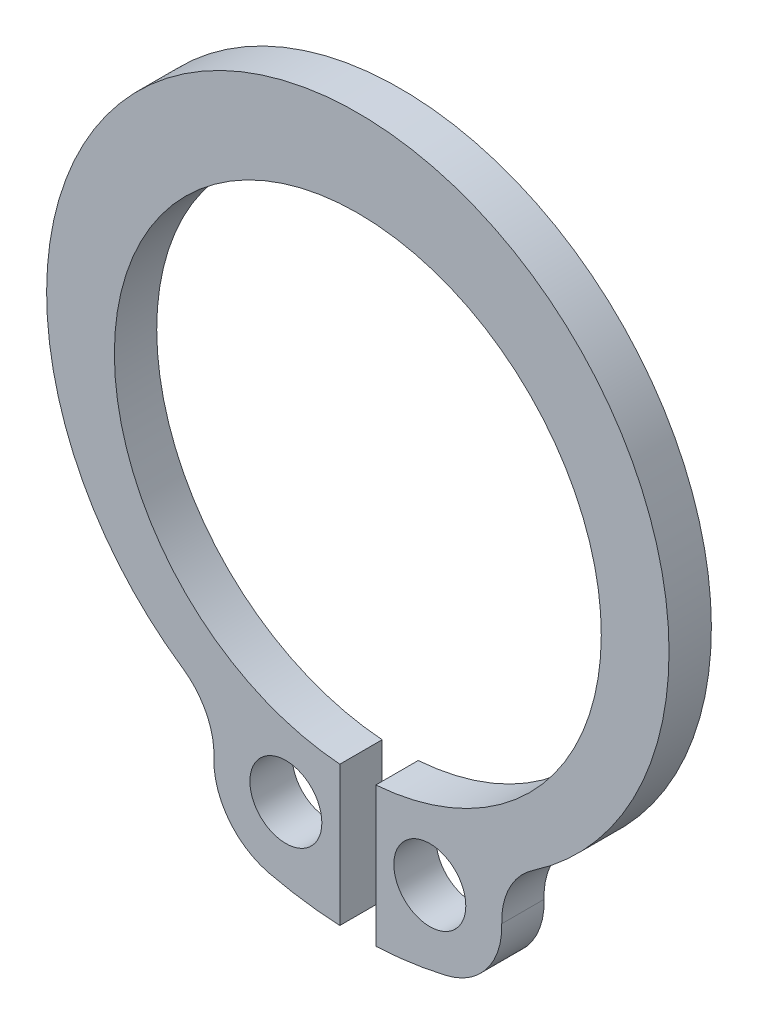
ISO-10303-21;
HEADER;
FILE_DESCRIPTION(('STEP AP214'),'2;1');
FILE_NAME('part.step','',(''),(''),'','','');
FILE_SCHEMA(('AUTOMOTIVE_DESIGN { 1 0 10303 214 1 1 1 1 }'));
ENDSEC;
DATA;
#1=APPLICATION_CONTEXT('core data for automotive mechanical design processes');
#2=APPLICATION_PROTOCOL_DEFINITION('international standard','automotive_design',2000,#1);
#3=PRODUCT_CONTEXT('',#1,'mechanical');
#4=PRODUCT('Part','Part','',(#3));
#5=PRODUCT_RELATED_PRODUCT_CATEGORY('part','',(#4));
#6=PRODUCT_DEFINITION_FORMATION('','',#4);
#7=PRODUCT_DEFINITION_CONTEXT('part definition',#1,'design');
#8=PRODUCT_DEFINITION('design','',#6,#7);
#9=PRODUCT_DEFINITION_SHAPE('','',#8);
#10=(LENGTH_UNIT() NAMED_UNIT(*) SI_UNIT(.MILLI.,.METRE.));
#11=(NAMED_UNIT(*) PLANE_ANGLE_UNIT() SI_UNIT($,.RADIAN.));
#12=(NAMED_UNIT(*) SI_UNIT($,.STERADIAN.) SOLID_ANGLE_UNIT());
#13=UNCERTAINTY_MEASURE_WITH_UNIT(LENGTH_MEASURE(1.E-05),#10,'distance_accuracy_value','');
#14=(GEOMETRIC_REPRESENTATION_CONTEXT(3) GLOBAL_UNCERTAINTY_ASSIGNED_CONTEXT((#13)) GLOBAL_UNIT_ASSIGNED_CONTEXT((#10,
#11,#12)) REPRESENTATION_CONTEXT('',''));
#15=CARTESIAN_POINT('',(0.,0.,0.));
#16=DIRECTION('',(0.,0.,1.));
#17=DIRECTION('',(1.,0.,0.));
#18=AXIS2_PLACEMENT_3D('',#15,#16,#17);
#19=CARTESIAN_POINT('',(0.,-7.12348782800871,1.));
#20=DIRECTION('',(0.,0.,1.));
#21=DIRECTION('',(1.,0.,0.));
#22=AXIS2_PLACEMENT_3D('',#19,#20,#21);
#23=PLANE('',#22);
#24=CARTESIAN_POINT('',(0.,-5.55,1.));
#25=DIRECTION('',(0.,0.,1.));
#26=DIRECTION('',(1.,0.,0.));
#27=AXIS2_PLACEMENT_3D('',#24,#25,#26);
#28=CIRCLE('',#27,7.35);
#29=CARTESIAN_POINT('',(-4.14034530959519,-11.6228939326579,1.));
#30=VERTEX_POINT('',#29);
#31=CARTESIAN_POINT('',(4.14034530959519,-11.6228939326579,1.));
#32=VERTEX_POINT('',#31);
#33=EDGE_CURVE('E126',#30,#32,#28,.F.);
#34=ORIENTED_EDGE('',*,*,#33,.F.);
#35=CARTESIAN_POINT('',(-5.09797619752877,-13.0275088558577,1.));
#36=DIRECTION('',(0.,0.,1.));
#37=DIRECTION('',(1.,0.,0.));
#38=AXIS2_PLACEMENT_3D('',#35,#36,#37);
#39=CIRCLE('',#38,1.7);
#40=CARTESIAN_POINT('',(-3.39898809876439,-13.0861555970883,1.));
#41=VERTEX_POINT('',#40);
#42=EDGE_CURVE('E123',#41,#30,#39,.T.);
#43=ORIENTED_EDGE('',*,*,#42,.F.);
#44=CARTESIAN_POINT('',(-1.7,-13.1448023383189,1.));
#45=DIRECTION('',(0.,0.,1.));
#46=DIRECTION('',(1.,0.,0.));
#47=AXIS2_PLACEMENT_3D('',#44,#45,#46);
#48=CIRCLE('',#47,1.7);
#49=CARTESIAN_POINT('',(-2.09350442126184,-14.7986325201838,1.));
#50=VERTEX_POINT('',#49);
#51=EDGE_CURVE('E99',#50,#41,#48,.F.);
#52=ORIENTED_EDGE('',*,*,#51,.F.);
#53=CARTESIAN_POINT('',(0.,-6.,1.));
#54=DIRECTION('',(0.,0.,1.));
#55=DIRECTION('',(1.,0.,0.));
#56=AXIS2_PLACEMENT_3D('',#53,#54,#55);
#57=CIRCLE('',#56,9.04426309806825);
#58=CARTESIAN_POINT('',(-0.425000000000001,-15.0342719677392,1.));
#59=VERTEX_POINT('',#58);
#60=EDGE_CURVE('E20',#50,#59,#57,.T.);
#61=ORIENTED_EDGE('',*,*,#60,.T.);
#62=DIRECTION('',(0.,1.,0.));
#63=VECTOR('',#62,1.);
#64=CARTESIAN_POINT('',(-0.425,-11.7342719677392,1.));
#65=LINE('',#64,#63);
#66=CARTESIAN_POINT('',(-0.425,-11.7342719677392,1.));
#67=VERTEX_POINT('',#66);
#68=EDGE_CURVE('E96',#67,#59,#65,.F.);
#69=ORIENTED_EDGE('',*,*,#68,.F.);
#70=CARTESIAN_POINT('',(0.,-6.,1.));
#71=DIRECTION('',(0.,0.,1.));
#72=DIRECTION('',(1.,0.,0.));
#73=AXIS2_PLACEMENT_3D('',#70,#71,#72);
#74=CIRCLE('',#73,5.75);
#75=CARTESIAN_POINT('',(0.425,-11.7342719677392,1.));
#76=VERTEX_POINT('',#75);
#77=EDGE_CURVE('E107',#76,#67,#74,.T.);
#78=ORIENTED_EDGE('',*,*,#77,.F.);
#79=DIRECTION('',(0.,-1.,0.));
#80=VECTOR('',#79,1.);
#81=CARTESIAN_POINT('',(0.424999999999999,-15.0342719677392,1.));
#82=LINE('',#81,#80);
#83=CARTESIAN_POINT('',(0.424999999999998,-15.0342719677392,1.));
#84=VERTEX_POINT('',#83);
#85=EDGE_CURVE('E138',#84,#76,#82,.F.);
#86=ORIENTED_EDGE('',*,*,#85,.F.);
#87=CARTESIAN_POINT('',(0.,-6.,1.));
#88=DIRECTION('',(0.,0.,1.));
#89=DIRECTION('',(1.,0.,0.));
#90=AXIS2_PLACEMENT_3D('',#87,#88,#89);
#91=CIRCLE('',#90,9.04426309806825);
#92=CARTESIAN_POINT('',(2.09350442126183,-14.7986325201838,1.));
#93=VERTEX_POINT('',#92);
#94=EDGE_CURVE('E135',#93,#84,#91,.F.);
#95=ORIENTED_EDGE('',*,*,#94,.F.);
#96=CARTESIAN_POINT('',(1.7,-13.1448023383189,1.));
#97=DIRECTION('',(0.,0.,1.));
#98=DIRECTION('',(1.,0.,0.));
#99=AXIS2_PLACEMENT_3D('',#96,#97,#98);
#100=CIRCLE('',#99,1.7);
#101=CARTESIAN_POINT('',(3.39898809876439,-13.0861555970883,1.));
#102=VERTEX_POINT('',#101);
#103=EDGE_CURVE('E132',#102,#93,#100,.F.);
#104=ORIENTED_EDGE('',*,*,#103,.F.);
#105=CARTESIAN_POINT('',(5.09797619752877,-13.0275088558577,1.));
#106=DIRECTION('',(0.,0.,1.));
#107=DIRECTION('',(1.,0.,0.));
#108=AXIS2_PLACEMENT_3D('',#105,#106,#107);
#109=CIRCLE('',#108,1.7);
#110=EDGE_CURVE('E129',#32,#102,#109,.T.);
#111=ORIENTED_EDGE('',*,*,#110,.F.);
#112=EDGE_LOOP('',(#34,#43,#52,#61,#69,#78,#86,#95,#104,#111));
#113=FACE_BOUND('',#112,.T.);
#114=CARTESIAN_POINT('',(-1.7,-13.1448023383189,1.));
#115=DIRECTION('',(0.,0.,1.));
#116=DIRECTION('',(1.,0.,0.));
#117=AXIS2_PLACEMENT_3D('',#114,#115,#116);
#118=CIRCLE('',#117,0.85);
#119=CARTESIAN_POINT('',(-0.85,-13.1448023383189,1.));
#120=VERTEX_POINT('',#119);
#121=EDGE_CURVE('E108',#120,#120,#118,.F.);
#122=ORIENTED_EDGE('',*,*,#121,.T.);
#123=EDGE_LOOP('',(#122));
#124=FACE_BOUND('',#123,.T.);
#125=CARTESIAN_POINT('',(1.7,-13.1448023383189,1.));
#126=DIRECTION('',(0.,0.,1.));
#127=DIRECTION('',(1.,0.,0.));
#128=AXIS2_PLACEMENT_3D('',#125,#126,#127);
#129=CIRCLE('',#128,0.85);
#130=CARTESIAN_POINT('',(2.55,-13.1448023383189,1.));
#131=VERTEX_POINT('',#130);
#132=EDGE_CURVE('E100',#131,#131,#129,.F.);
#133=ORIENTED_EDGE('',*,*,#132,.T.);
#134=EDGE_LOOP('',(#133));
#135=FACE_BOUND('',#134,.T.);
#136=ADVANCED_FACE('F16',(#113,#124,#135),#23,.T.);
#137=CARTESIAN_POINT('',(1.7,-13.1448023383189,0.));
#138=DIRECTION('',(0.,0.,1.));
#139=DIRECTION('',(1.,0.,0.));
#140=AXIS2_PLACEMENT_3D('',#137,#138,#139);
#141=CYLINDRICAL_SURFACE('',#140,0.85);
#142=CARTESIAN_POINT('',(1.7,-13.1448023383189,0.));
#143=DIRECTION('',(0.,0.,1.));
#144=DIRECTION('',(1.,0.,0.));
#145=AXIS2_PLACEMENT_3D('',#142,#143,#144);
#146=CIRCLE('',#145,0.85);
#147=CARTESIAN_POINT('',(2.55,-13.1448023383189,0.));
#148=VERTEX_POINT('',#147);
#149=EDGE_CURVE('E111',#148,#148,#146,.F.);
#150=ORIENTED_EDGE('',*,*,#149,.T.);
#151=EDGE_LOOP('',(#150));
#152=FACE_BOUND('',#151,.T.);
#153=ORIENTED_EDGE('',*,*,#132,.F.);
#154=EDGE_LOOP('',(#153));
#155=FACE_BOUND('',#154,.T.);
#156=ADVANCED_FACE('F177',(#152,#155),#141,.F.);
#157=CARTESIAN_POINT('',(-1.7,-13.1448023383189,0.));
#158=DIRECTION('',(0.,0.,1.));
#159=DIRECTION('',(1.,0.,0.));
#160=AXIS2_PLACEMENT_3D('',#157,#158,#159);
#161=CYLINDRICAL_SURFACE('',#160,0.85);
#162=CARTESIAN_POINT('',(-1.7,-13.1448023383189,0.));
#163=DIRECTION('',(0.,0.,1.));
#164=DIRECTION('',(1.,0.,0.));
#165=AXIS2_PLACEMENT_3D('',#162,#163,#164);
#166=CIRCLE('',#165,0.85);
#167=CARTESIAN_POINT('',(-0.85,-13.1448023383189,0.));
#168=VERTEX_POINT('',#167);
#169=EDGE_CURVE('E114',#168,#168,#166,.F.);
#170=ORIENTED_EDGE('',*,*,#169,.T.);
#171=EDGE_LOOP('',(#170));
#172=FACE_BOUND('',#171,.T.);
#173=ORIENTED_EDGE('',*,*,#121,.F.);
#174=EDGE_LOOP('',(#173));
#175=FACE_BOUND('',#174,.T.);
#176=ADVANCED_FACE('F179',(#172,#175),#161,.F.);
#177=CARTESIAN_POINT('',(-0.425,-11.7342719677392,0.));
#178=DIRECTION('',(1.,0.,0.));
#179=DIRECTION('',(0.,0.,-1.));
#180=AXIS2_PLACEMENT_3D('',#177,#178,#179);
#181=PLANE('',#180);
#182=DIRECTION('',(0.,1.,0.));
#183=VECTOR('',#182,1.);
#184=CARTESIAN_POINT('',(-0.424999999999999,-7.12348782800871,0.));
#185=LINE('',#184,#183);
#186=CARTESIAN_POINT('',(-0.425,-15.0342719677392,0.));
#187=VERTEX_POINT('',#186);
#188=CARTESIAN_POINT('',(-0.425,-11.7342719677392,0.));
#189=VERTEX_POINT('',#188);
#190=EDGE_CURVE('E162',#187,#189,#185,.T.);
#191=ORIENTED_EDGE('',*,*,#190,.T.);
#192=DIRECTION('',(0.,0.,1.));
#193=VECTOR('',#192,1.);
#194=CARTESIAN_POINT('',(-0.425,-11.7342719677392,0.));
#195=LINE('',#194,#193);
#196=EDGE_CURVE('E106',#67,#189,#195,.F.);
#197=ORIENTED_EDGE('',*,*,#196,.F.);
#198=ORIENTED_EDGE('',*,*,#68,.T.);
#199=DIRECTION('',(0.,0.,1.));
#200=VECTOR('',#199,1.);
#201=CARTESIAN_POINT('',(-0.425000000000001,-15.0342719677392,0.));
#202=LINE('',#201,#200);
#203=EDGE_CURVE('E105',#187,#59,#202,.T.);
#204=ORIENTED_EDGE('',*,*,#203,.F.);
#205=EDGE_LOOP('',(#191,#197,#198,#204));
#206=FACE_BOUND('',#205,.T.);
#207=ADVANCED_FACE('F104',(#206),#181,.T.);
#208=CARTESIAN_POINT('',(0.,-6.,0.));
#209=DIRECTION('',(0.,0.,1.));
#210=DIRECTION('',(1.,0.,0.));
#211=AXIS2_PLACEMENT_3D('',#208,#209,#210);
#212=CYLINDRICAL_SURFACE('',#211,5.75);
#213=CARTESIAN_POINT('',(0.,-6.,0.));
#214=DIRECTION('',(0.,0.,1.));
#215=DIRECTION('',(1.,0.,0.));
#216=AXIS2_PLACEMENT_3D('',#213,#214,#215);
#217=CIRCLE('',#216,5.75);
#218=CARTESIAN_POINT('',(0.425,-11.7342719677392,0.));
#219=VERTEX_POINT('',#218);
#220=EDGE_CURVE('E159',#189,#219,#217,.F.);
#221=ORIENTED_EDGE('',*,*,#220,.T.);
#222=DIRECTION('',(0.,0.,1.));
#223=VECTOR('',#222,1.);
#224=CARTESIAN_POINT('',(0.425,-11.7342719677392,0.));
#225=LINE('',#224,#223);
#226=EDGE_CURVE('E136',#76,#219,#225,.F.);
#227=ORIENTED_EDGE('',*,*,#226,.F.);
#228=ORIENTED_EDGE('',*,*,#77,.T.);
#229=ORIENTED_EDGE('',*,*,#196,.T.);
#230=EDGE_LOOP('',(#221,#227,#228,#229));
#231=FACE_BOUND('',#230,.T.);
#232=ADVANCED_FACE('F235',(#231),#212,.F.);
#233=CARTESIAN_POINT('',(0.424999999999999,-15.0342719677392,0.));
#234=DIRECTION('',(-1.,0.,0.));
#235=DIRECTION('',(0.,-1.,0.));
#236=AXIS2_PLACEMENT_3D('',#233,#234,#235);
#237=PLANE('',#236);
#238=DIRECTION('',(0.,1.,0.));
#239=VECTOR('',#238,1.);
#240=CARTESIAN_POINT('',(0.425,-7.12348782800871,0.));
#241=LINE('',#240,#239);
#242=CARTESIAN_POINT('',(0.424999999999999,-15.0342719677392,0.));
#243=VERTEX_POINT('',#242);
#244=EDGE_CURVE('E158',#219,#243,#241,.F.);
#245=ORIENTED_EDGE('',*,*,#244,.T.);
#246=DIRECTION('',(0.,0.,1.));
#247=VECTOR('',#246,1.);
#248=CARTESIAN_POINT('',(0.424999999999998,-15.0342719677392,0.));
#249=LINE('',#248,#247);
#250=EDGE_CURVE('E133',#84,#243,#249,.F.);
#251=ORIENTED_EDGE('',*,*,#250,.F.);
#252=ORIENTED_EDGE('',*,*,#85,.T.);
#253=ORIENTED_EDGE('',*,*,#226,.T.);
#254=EDGE_LOOP('',(#245,#251,#252,#253));
#255=FACE_BOUND('',#254,.T.);
#256=ADVANCED_FACE('F230',(#255),#237,.T.);
#257=CARTESIAN_POINT('',(0.,-6.,0.));
#258=DIRECTION('',(0.,0.,1.));
#259=DIRECTION('',(1.,0.,0.));
#260=AXIS2_PLACEMENT_3D('',#257,#258,#259);
#261=CYLINDRICAL_SURFACE('',#260,9.04426309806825);
#262=CARTESIAN_POINT('',(0.,-6.,0.));
#263=DIRECTION('',(0.,0.,1.));
#264=DIRECTION('',(1.,0.,0.));
#265=AXIS2_PLACEMENT_3D('',#262,#263,#264);
#266=CIRCLE('',#265,9.04426309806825);
#267=CARTESIAN_POINT('',(2.09350442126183,-14.7986325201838,0.));
#268=VERTEX_POINT('',#267);
#269=EDGE_CURVE('E155',#243,#268,#266,.T.);
#270=ORIENTED_EDGE('',*,*,#269,.T.);
#271=DIRECTION('',(0.,0.,1.));
#272=VECTOR('',#271,1.);
#273=CARTESIAN_POINT('',(2.09350442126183,-14.7986325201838,0.));
#274=LINE('',#273,#272);
#275=EDGE_CURVE('E130',#93,#268,#274,.F.);
#276=ORIENTED_EDGE('',*,*,#275,.F.);
#277=ORIENTED_EDGE('',*,*,#94,.T.);
#278=ORIENTED_EDGE('',*,*,#250,.T.);
#279=EDGE_LOOP('',(#270,#276,#277,#278));
#280=FACE_BOUND('',#279,.T.);
#281=ADVANCED_FACE('F226',(#280),#261,.T.);
#282=CARTESIAN_POINT('',(1.7,-13.1448023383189,0.));
#283=DIRECTION('',(0.,0.,1.));
#284=DIRECTION('',(1.,0.,0.));
#285=AXIS2_PLACEMENT_3D('',#282,#283,#284);
#286=CYLINDRICAL_SURFACE('',#285,1.7);
#287=CARTESIAN_POINT('',(1.7,-13.1448023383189,0.));
#288=DIRECTION('',(0.,0.,1.));
#289=DIRECTION('',(1.,0.,0.));
#290=AXIS2_PLACEMENT_3D('',#287,#288,#289);
#291=CIRCLE('',#290,1.7);
#292=CARTESIAN_POINT('',(3.39898809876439,-13.0861555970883,0.));
#293=VERTEX_POINT('',#292);
#294=EDGE_CURVE('E152',#268,#293,#291,.T.);
#295=ORIENTED_EDGE('',*,*,#294,.T.);
#296=DIRECTION('',(0.,0.,1.));
#297=VECTOR('',#296,1.);
#298=CARTESIAN_POINT('',(3.39898809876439,-13.0861555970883,0.));
#299=LINE('',#298,#297);
#300=EDGE_CURVE('E127',#102,#293,#299,.F.);
#301=ORIENTED_EDGE('',*,*,#300,.F.);
#302=ORIENTED_EDGE('',*,*,#103,.T.);
#303=ORIENTED_EDGE('',*,*,#275,.T.);
#304=EDGE_LOOP('',(#295,#301,#302,#303));
#305=FACE_BOUND('',#304,.T.);
#306=ADVANCED_FACE('F219',(#305),#286,.T.);
#307=CARTESIAN_POINT('',(5.09797619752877,-13.0275088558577,0.));
#308=DIRECTION('',(0.,0.,1.));
#309=DIRECTION('',(1.,0.,0.));
#310=AXIS2_PLACEMENT_3D('',#307,#308,#309);
#311=CYLINDRICAL_SURFACE('',#310,1.7);
#312=CARTESIAN_POINT('',(5.09797619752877,-13.0275088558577,0.));
#313=DIRECTION('',(0.,0.,1.));
#314=DIRECTION('',(1.,0.,0.));
#315=AXIS2_PLACEMENT_3D('',#312,#313,#314);
#316=CIRCLE('',#315,1.7);
#317=CARTESIAN_POINT('',(4.14034530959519,-11.6228939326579,0.));
#318=VERTEX_POINT('',#317);
#319=EDGE_CURVE('E149',#293,#318,#316,.F.);
#320=ORIENTED_EDGE('',*,*,#319,.T.);
#321=DIRECTION('',(0.,0.,1.));
#322=VECTOR('',#321,1.);
#323=CARTESIAN_POINT('',(4.14034530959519,-11.6228939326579,0.));
#324=LINE('',#323,#322);
#325=EDGE_CURVE('E124',#32,#318,#324,.F.);
#326=ORIENTED_EDGE('',*,*,#325,.F.);
#327=ORIENTED_EDGE('',*,*,#110,.T.);
#328=ORIENTED_EDGE('',*,*,#300,.T.);
#329=EDGE_LOOP('',(#320,#326,#327,#328));
#330=FACE_BOUND('',#329,.T.);
#331=ADVANCED_FACE('F215',(#330),#311,.F.);
#332=CARTESIAN_POINT('',(0.,-5.55,0.));
#333=DIRECTION('',(0.,0.,1.));
#334=DIRECTION('',(1.,0.,0.));
#335=AXIS2_PLACEMENT_3D('',#332,#333,#334);
#336=CYLINDRICAL_SURFACE('',#335,7.35);
#337=CARTESIAN_POINT('',(0.,-5.55,0.));
#338=DIRECTION('',(0.,0.,1.));
#339=DIRECTION('',(1.,0.,0.));
#340=AXIS2_PLACEMENT_3D('',#337,#338,#339);
#341=CIRCLE('',#340,7.35);
#342=CARTESIAN_POINT('',(-4.14034530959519,-11.6228939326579,0.));
#343=VERTEX_POINT('',#342);
#344=EDGE_CURVE('E146',#318,#343,#341,.T.);
#345=ORIENTED_EDGE('',*,*,#344,.T.);
#346=DIRECTION('',(0.,0.,1.));
#347=VECTOR('',#346,1.);
#348=CARTESIAN_POINT('',(-4.14034530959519,-11.6228939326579,0.));
#349=LINE('',#348,#347);
#350=EDGE_CURVE('E121',#30,#343,#349,.F.);
#351=ORIENTED_EDGE('',*,*,#350,.F.);
#352=ORIENTED_EDGE('',*,*,#33,.T.);
#353=ORIENTED_EDGE('',*,*,#325,.T.);
#354=EDGE_LOOP('',(#345,#351,#352,#353));
#355=FACE_BOUND('',#354,.T.);
#356=ADVANCED_FACE('F209',(#355),#336,.T.);
#357=CARTESIAN_POINT('',(-5.09797619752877,-13.0275088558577,0.));
#358=DIRECTION('',(0.,0.,1.));
#359=DIRECTION('',(1.,0.,0.));
#360=AXIS2_PLACEMENT_3D('',#357,#358,#359);
#361=CYLINDRICAL_SURFACE('',#360,1.7);
#362=CARTESIAN_POINT('',(-5.09797619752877,-13.0275088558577,0.));
#363=DIRECTION('',(0.,0.,1.));
#364=DIRECTION('',(1.,0.,0.));
#365=AXIS2_PLACEMENT_3D('',#362,#363,#364);
#366=CIRCLE('',#365,1.7);
#367=CARTESIAN_POINT('',(-3.39898809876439,-13.0861555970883,0.));
#368=VERTEX_POINT('',#367);
#369=EDGE_CURVE('E143',#343,#368,#366,.F.);
#370=ORIENTED_EDGE('',*,*,#369,.T.);
#371=DIRECTION('',(0.,0.,1.));
#372=VECTOR('',#371,1.);
#373=CARTESIAN_POINT('',(-3.39898809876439,-13.0861555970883,0.));
#374=LINE('',#373,#372);
#375=EDGE_CURVE('E116',#41,#368,#374,.F.);
#376=ORIENTED_EDGE('',*,*,#375,.F.);
#377=ORIENTED_EDGE('',*,*,#42,.T.);
#378=ORIENTED_EDGE('',*,*,#350,.T.);
#379=EDGE_LOOP('',(#370,#376,#377,#378));
#380=FACE_BOUND('',#379,.T.);
#381=ADVANCED_FACE('F206',(#380),#361,.F.);
#382=CARTESIAN_POINT('',(-1.7,-13.1448023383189,0.));
#383=DIRECTION('',(0.,0.,1.));
#384=DIRECTION('',(1.,0.,0.));
#385=AXIS2_PLACEMENT_3D('',#382,#383,#384);
#386=CYLINDRICAL_SURFACE('',#385,1.7);
#387=CARTESIAN_POINT('',(-1.7,-13.1448023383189,0.));
#388=DIRECTION('',(0.,0.,1.));
#389=DIRECTION('',(1.,0.,0.));
#390=AXIS2_PLACEMENT_3D('',#387,#388,#389);
#391=CIRCLE('',#390,1.7);
#392=CARTESIAN_POINT('',(-2.09350442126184,-14.7986325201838,0.));
#393=VERTEX_POINT('',#392);
#394=EDGE_CURVE('E26',#368,#393,#391,.T.);
#395=ORIENTED_EDGE('',*,*,#394,.T.);
#396=DIRECTION('',(0.,0.,1.));
#397=VECTOR('',#396,1.);
#398=CARTESIAN_POINT('',(-2.09350442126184,-14.7986325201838,0.));
#399=LINE('',#398,#397);
#400=EDGE_CURVE('E34',#50,#393,#399,.F.);
#401=ORIENTED_EDGE('',*,*,#400,.F.);
#402=ORIENTED_EDGE('',*,*,#51,.T.);
#403=ORIENTED_EDGE('',*,*,#375,.T.);
#404=EDGE_LOOP('',(#395,#401,#402,#403));
#405=FACE_BOUND('',#404,.T.);
#406=ADVANCED_FACE('F193',(#405),#386,.T.);
#407=CARTESIAN_POINT('',(0.,-6.,0.));
#408=DIRECTION('',(0.,0.,1.));
#409=DIRECTION('',(1.,0.,0.));
#410=AXIS2_PLACEMENT_3D('',#407,#408,#409);
#411=CYLINDRICAL_SURFACE('',#410,9.04426309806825);
#412=CARTESIAN_POINT('',(0.,-6.,0.));
#413=DIRECTION('',(0.,0.,1.));
#414=DIRECTION('',(1.,0.,0.));
#415=AXIS2_PLACEMENT_3D('',#412,#413,#414);
#416=CIRCLE('',#415,9.04426309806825);
#417=EDGE_CURVE('E10',#393,#187,#416,.T.);
#418=ORIENTED_EDGE('',*,*,#417,.T.);
#419=ORIENTED_EDGE('',*,*,#203,.T.);
#420=ORIENTED_EDGE('',*,*,#60,.F.);
#421=ORIENTED_EDGE('',*,*,#400,.T.);
#422=EDGE_LOOP('',(#418,#419,#420,#421));
#423=FACE_BOUND('',#422,.T.);
#424=ADVANCED_FACE('F110',(#423),#411,.T.);
#425=CARTESIAN_POINT('',(0.,-7.12348782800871,0.));
#426=DIRECTION('',(0.,0.,1.));
#427=DIRECTION('',(1.,0.,0.));
#428=AXIS2_PLACEMENT_3D('',#425,#426,#427);
#429=PLANE('',#428);
#430=ORIENTED_EDGE('',*,*,#394,.F.);
#431=ORIENTED_EDGE('',*,*,#369,.F.);
#432=ORIENTED_EDGE('',*,*,#344,.F.);
#433=ORIENTED_EDGE('',*,*,#319,.F.);
#434=ORIENTED_EDGE('',*,*,#294,.F.);
#435=ORIENTED_EDGE('',*,*,#269,.F.);
#436=ORIENTED_EDGE('',*,*,#244,.F.);
#437=ORIENTED_EDGE('',*,*,#220,.F.);
#438=ORIENTED_EDGE('',*,*,#190,.F.);
#439=ORIENTED_EDGE('',*,*,#417,.F.);
#440=EDGE_LOOP('',(#430,#431,#432,#433,#434,#435,#436,#437,#438,#439));
#441=FACE_BOUND('',#440,.T.);
#442=ORIENTED_EDGE('',*,*,#169,.F.);
#443=EDGE_LOOP('',(#442));
#444=FACE_BOUND('',#443,.T.);
#445=ORIENTED_EDGE('',*,*,#149,.F.);
#446=EDGE_LOOP('',(#445));
#447=FACE_BOUND('',#446,.T.);
#448=ADVANCED_FACE('F18',(#441,#444,#447),#429,.F.);
#449=CLOSED_SHELL('',(#136,#156,#176,#207,#232,#256,#281,#306,#331,#356,#381,#406,#424,#448));
#450=MANIFOLD_SOLID_BREP('B1',#449);
#451=ADVANCED_BREP_SHAPE_REPRESENTATION('',(#18,#450),#14);
#452=SHAPE_DEFINITION_REPRESENTATION(#9,#451);
ENDSEC;
END-ISO-10303-21;
